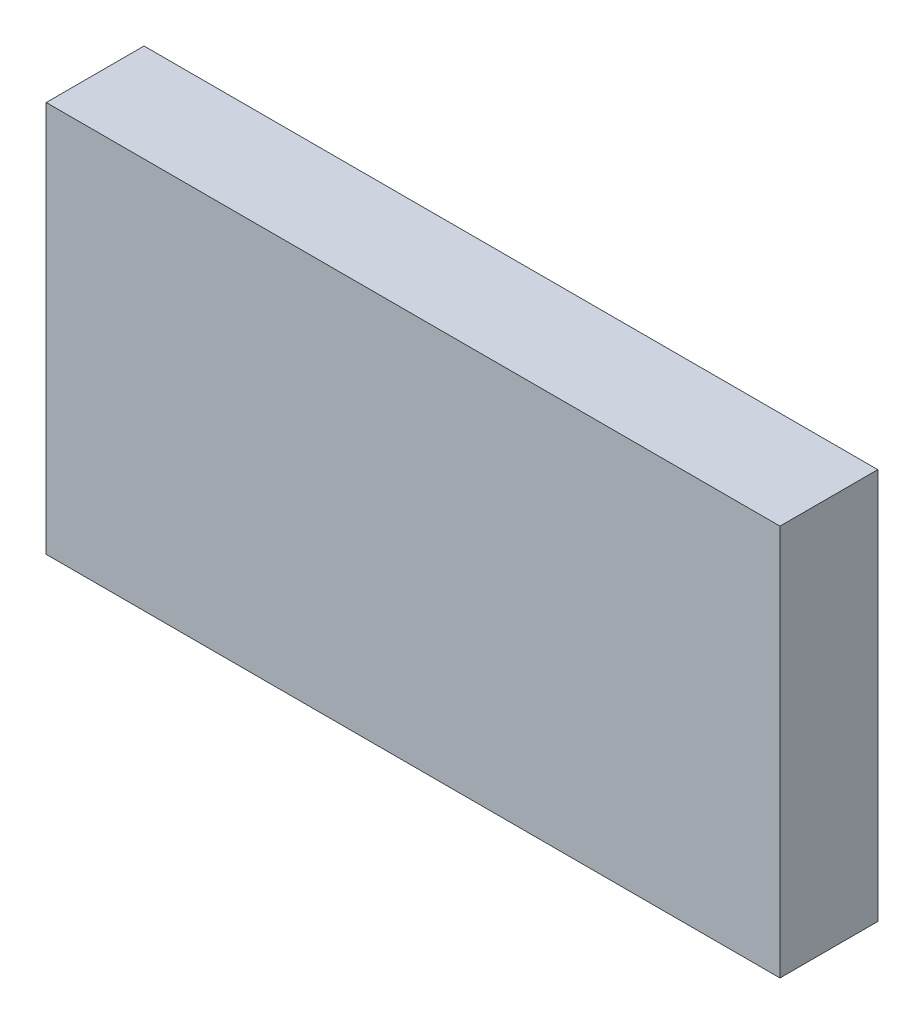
ISO-10303-21;
HEADER;
FILE_DESCRIPTION(('STEP AP214'),'2;1');
FILE_NAME('part.step','',(''),(''),'','','');
FILE_SCHEMA(('AUTOMOTIVE_DESIGN { 1 0 10303 214 1 1 1 1 }'));
ENDSEC;
DATA;
#1=APPLICATION_CONTEXT('core data for automotive mechanical design processes');
#2=APPLICATION_PROTOCOL_DEFINITION('international standard','automotive_design',2000,#1);
#3=PRODUCT_CONTEXT('',#1,'mechanical');
#4=PRODUCT('Part','Part','',(#3));
#5=PRODUCT_RELATED_PRODUCT_CATEGORY('part','',(#4));
#6=PRODUCT_DEFINITION_FORMATION('','',#4);
#7=PRODUCT_DEFINITION_CONTEXT('part definition',#1,'design');
#8=PRODUCT_DEFINITION('design','',#6,#7);
#9=PRODUCT_DEFINITION_SHAPE('','',#8);
#10=(LENGTH_UNIT() NAMED_UNIT(*) SI_UNIT(.MILLI.,.METRE.));
#11=(NAMED_UNIT(*) PLANE_ANGLE_UNIT() SI_UNIT($,.RADIAN.));
#12=(NAMED_UNIT(*) SI_UNIT($,.STERADIAN.) SOLID_ANGLE_UNIT());
#13=UNCERTAINTY_MEASURE_WITH_UNIT(LENGTH_MEASURE(1.E-05),#10,'distance_accuracy_value','');
#14=(GEOMETRIC_REPRESENTATION_CONTEXT(3) GLOBAL_UNCERTAINTY_ASSIGNED_CONTEXT((#13)) GLOBAL_UNIT_ASSIGNED_CONTEXT((#10,
#11,#12)) REPRESENTATION_CONTEXT('',''));
#15=CARTESIAN_POINT('',(0.,0.,0.));
#16=DIRECTION('',(0.,0.,1.));
#17=DIRECTION('',(1.,0.,0.));
#18=AXIS2_PLACEMENT_3D('',#15,#16,#17);
#19=CARTESIAN_POINT('',(150.,0.,0.));
#20=DIRECTION('',(0.,0.,-1.));
#21=DIRECTION('',(-1.,0.,0.));
#22=AXIS2_PLACEMENT_3D('',#19,#20,#21);
#23=PLANE('',#22);
#24=DIRECTION('',(0.,-1.,0.));
#25=VECTOR('',#24,1.);
#26=CARTESIAN_POINT('',(-150.,0.,0.));
#27=LINE('',#26,#25);
#28=CARTESIAN_POINT('',(-150.,160.,0.));
#29=VERTEX_POINT('',#28);
#30=CARTESIAN_POINT('',(-150.,0.,0.));
#31=VERTEX_POINT('',#30);
#32=EDGE_CURVE('E96',#29,#31,#27,.T.);
#33=ORIENTED_EDGE('',*,*,#32,.T.);
#34=DIRECTION('',(-1.,0.,0.));
#35=VECTOR('',#34,1.);
#36=CARTESIAN_POINT('',(150.,0.,0.));
#37=LINE('',#36,#35);
#38=CARTESIAN_POINT('',(150.,0.,0.));
#39=VERTEX_POINT('',#38);
#40=EDGE_CURVE('E11',#39,#31,#37,.T.);
#41=ORIENTED_EDGE('',*,*,#40,.F.);
#42=DIRECTION('',(0.,-1.,0.));
#43=VECTOR('',#42,1.);
#44=CARTESIAN_POINT('',(150.,0.,0.));
#45=LINE('',#44,#43);
#46=CARTESIAN_POINT('',(150.,160.,0.));
#47=VERTEX_POINT('',#46);
#48=EDGE_CURVE('E84',#47,#39,#45,.T.);
#49=ORIENTED_EDGE('',*,*,#48,.F.);
#50=DIRECTION('',(-1.,0.,0.));
#51=VECTOR('',#50,1.);
#52=CARTESIAN_POINT('',(150.,160.,0.));
#53=LINE('',#52,#51);
#54=EDGE_CURVE('E92',#47,#29,#53,.T.);
#55=ORIENTED_EDGE('',*,*,#54,.T.);
#56=EDGE_LOOP('',(#33,#41,#49,#55));
#57=FACE_BOUND('',#56,.T.);
#58=ADVANCED_FACE('F33',(#57),#23,.F.);
#59=CARTESIAN_POINT('',(150.,0.,0.));
#60=DIRECTION('',(0.,1.,0.));
#61=DIRECTION('',(0.,0.,1.));
#62=AXIS2_PLACEMENT_3D('',#59,#60,#61);
#63=PLANE('',#62);
#64=DIRECTION('',(0.,0.,-1.));
#65=VECTOR('',#64,1.);
#66=CARTESIAN_POINT('',(-150.,0.,0.));
#67=LINE('',#66,#65);
#68=CARTESIAN_POINT('',(-150.,0.,-40.));
#69=VERTEX_POINT('',#68);
#70=EDGE_CURVE('E88',#31,#69,#67,.T.);
#71=ORIENTED_EDGE('',*,*,#70,.T.);
#72=DIRECTION('',(-1.,0.,0.));
#73=VECTOR('',#72,1.);
#74=CARTESIAN_POINT('',(150.,0.,-40.));
#75=LINE('',#74,#73);
#76=CARTESIAN_POINT('',(150.,0.,-40.));
#77=VERTEX_POINT('',#76);
#78=EDGE_CURVE('E41',#77,#69,#75,.T.);
#79=ORIENTED_EDGE('',*,*,#78,.F.);
#80=DIRECTION('',(0.,0.,-1.));
#81=VECTOR('',#80,1.);
#82=CARTESIAN_POINT('',(150.,0.,0.));
#83=LINE('',#82,#81);
#84=EDGE_CURVE('E79',#39,#77,#83,.T.);
#85=ORIENTED_EDGE('',*,*,#84,.F.);
#86=ORIENTED_EDGE('',*,*,#40,.T.);
#87=EDGE_LOOP('',(#71,#79,#85,#86));
#88=FACE_BOUND('',#87,.T.);
#89=ADVANCED_FACE('F87',(#88),#63,.F.);
#90=CARTESIAN_POINT('',(150.,0.,-40.));
#91=DIRECTION('',(0.,0.,1.));
#92=DIRECTION('',(1.,0.,0.));
#93=AXIS2_PLACEMENT_3D('',#90,#91,#92);
#94=PLANE('',#93);
#95=DIRECTION('',(0.,1.,0.));
#96=VECTOR('',#95,1.);
#97=CARTESIAN_POINT('',(-150.,0.,-40.));
#98=LINE('',#97,#96);
#99=CARTESIAN_POINT('',(-150.,160.,-40.));
#100=VERTEX_POINT('',#99);
#101=EDGE_CURVE('E66',#69,#100,#98,.T.);
#102=ORIENTED_EDGE('',*,*,#101,.T.);
#103=DIRECTION('',(-1.,0.,0.));
#104=VECTOR('',#103,1.);
#105=CARTESIAN_POINT('',(150.,160.,-40.));
#106=LINE('',#105,#104);
#107=CARTESIAN_POINT('',(150.,160.,-40.));
#108=VERTEX_POINT('',#107);
#109=EDGE_CURVE('E89',#108,#100,#106,.T.);
#110=ORIENTED_EDGE('',*,*,#109,.F.);
#111=DIRECTION('',(0.,1.,0.));
#112=VECTOR('',#111,1.);
#113=CARTESIAN_POINT('',(150.,0.,-40.));
#114=LINE('',#113,#112);
#115=EDGE_CURVE('E82',#77,#108,#114,.T.);
#116=ORIENTED_EDGE('',*,*,#115,.F.);
#117=ORIENTED_EDGE('',*,*,#78,.T.);
#118=EDGE_LOOP('',(#102,#110,#116,#117));
#119=FACE_BOUND('',#118,.T.);
#120=ADVANCED_FACE('F90',(#119),#94,.F.);
#121=CARTESIAN_POINT('',(150.,160.,0.));
#122=DIRECTION('',(0.,-1.,0.));
#123=DIRECTION('',(0.,0.,-1.));
#124=AXIS2_PLACEMENT_3D('',#121,#122,#123);
#125=PLANE('',#124);
#126=DIRECTION('',(0.,0.,1.));
#127=VECTOR('',#126,1.);
#128=CARTESIAN_POINT('',(-150.,160.,0.));
#129=LINE('',#128,#127);
#130=EDGE_CURVE('E72',#100,#29,#129,.T.);
#131=ORIENTED_EDGE('',*,*,#130,.T.);
#132=ORIENTED_EDGE('',*,*,#54,.F.);
#133=DIRECTION('',(0.,0.,1.));
#134=VECTOR('',#133,1.);
#135=CARTESIAN_POINT('',(150.,160.,0.));
#136=LINE('',#135,#134);
#137=EDGE_CURVE('E49',#108,#47,#136,.T.);
#138=ORIENTED_EDGE('',*,*,#137,.F.);
#139=ORIENTED_EDGE('',*,*,#109,.T.);
#140=EDGE_LOOP('',(#131,#132,#138,#139));
#141=FACE_BOUND('',#140,.T.);
#142=ADVANCED_FACE('F103',(#141),#125,.F.);
#143=CARTESIAN_POINT('',(150.,0.,0.));
#144=DIRECTION('',(-1.,0.,0.));
#145=DIRECTION('',(0.,0.,1.));
#146=AXIS2_PLACEMENT_3D('',#143,#144,#145);
#147=PLANE('',#146);
#148=ORIENTED_EDGE('',*,*,#48,.T.);
#149=ORIENTED_EDGE('',*,*,#84,.T.);
#150=ORIENTED_EDGE('',*,*,#115,.T.);
#151=ORIENTED_EDGE('',*,*,#137,.T.);
#152=EDGE_LOOP('',(#148,#149,#150,#151));
#153=FACE_BOUND('',#152,.T.);
#154=ADVANCED_FACE('F80',(#153),#147,.F.);
#155=CARTESIAN_POINT('',(-150.,0.,0.));
#156=DIRECTION('',(-1.,0.,0.));
#157=DIRECTION('',(0.,0.,1.));
#158=AXIS2_PLACEMENT_3D('',#155,#156,#157);
#159=PLANE('',#158);
#160=ORIENTED_EDGE('',*,*,#32,.F.);
#161=ORIENTED_EDGE('',*,*,#130,.F.);
#162=ORIENTED_EDGE('',*,*,#101,.F.);
#163=ORIENTED_EDGE('',*,*,#70,.F.);
#164=EDGE_LOOP('',(#160,#161,#162,#163));
#165=FACE_BOUND('',#164,.T.);
#166=ADVANCED_FACE('F106',(#165),#159,.T.);
#167=CLOSED_SHELL('',(#58,#89,#120,#142,#154,#166));
#168=MANIFOLD_SOLID_BREP('B2',#167);
#169=ADVANCED_BREP_SHAPE_REPRESENTATION('',(#18,#168),#14);
#170=SHAPE_DEFINITION_REPRESENTATION(#9,#169);
ENDSEC;
END-ISO-10303-21;
